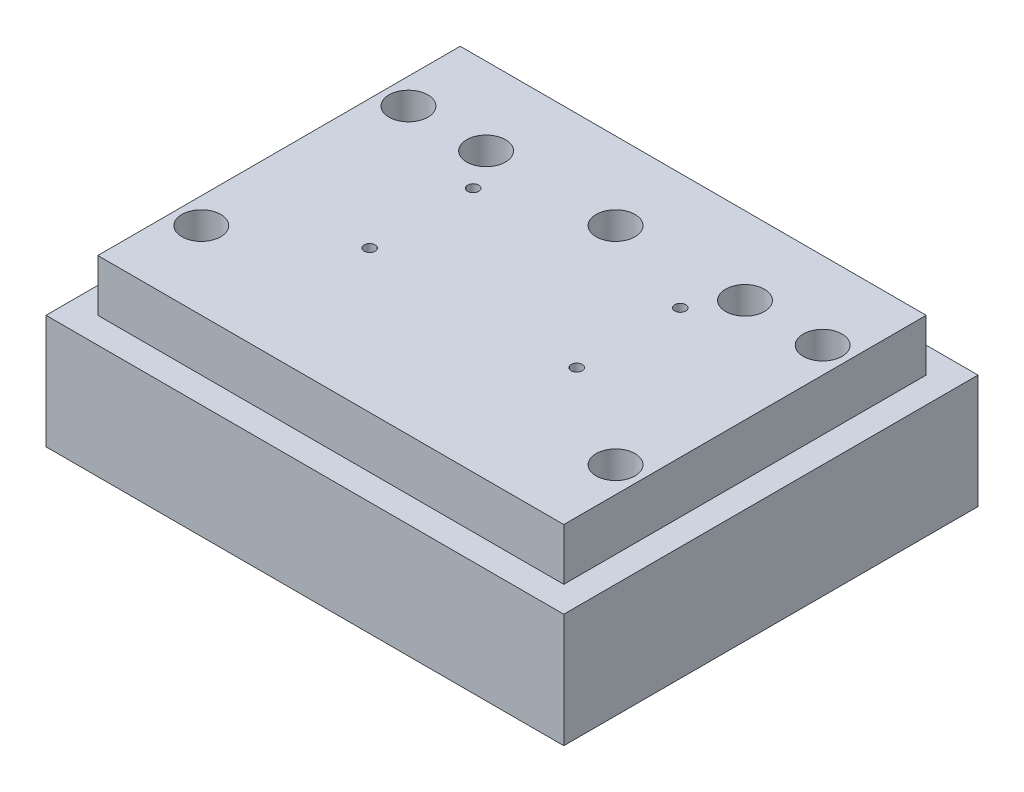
from build123d import *

# Parameters (mm, degrees)
SKETCH1_W                        = 127
SKETCH1_H                        = 101.6
BOSS_EXTRUDE1_DEPTH              = 27.94
SKETCH2_W                        = 114.3
SKETCH2_H                        = 88.9
BOSS_EXTRUDE2_DEPTH              = 12.7
F_3_8_0_375_DIAMETER_HOLE1_D     = 9.525
F_3_8_0_375_DIAMETER_HOLE2_D     = 9.525
F_3_8_0_375_DIAMETER_HOLE2_DEPTH = 33.02
F_3_8_0_375_DIAMETER_HOLE2_TIP   = 2.861599
F_3_8_24_TAPPED_HOLE1_D          = 8.4328
F_3_8_24_TAPPED_HOLE1_DEPTH      = 25.4
F_3_8_24_TAPPED_HOLE1_TIP        = 2.533469
F_3_8_0_375_DIAMETER_HOLE3_D     = 9.525
F_3_8_0_375_DIAMETER_HOLE3_DEPTH = 25.4
F_3_8_0_375_DIAMETER_HOLE3_TIP   = 2.861599
F_6_32_TAPPED_HOLE1_D            = 2.7051
F_6_32_TAPPED_HOLE1_DEPTH        = 7.62
F_6_32_TAPPED_HOLE1_TIP          = 0.812694
SKETCH15_W                       = 29.21
SKETCH15_H                       = 11.43
SKETCH15_W_2                     = 20.828
CUT_EXTRUDE1_DEPTH               = 12.7
F_4_40_TAPPED_HOLE1_D            = 2.2606
F_4_40_TAPPED_HOLE1_DEPTH        = 9.525
F_4_40_TAPPED_HOLE1_TIP          = 0.679153


with BuildPart() as part:
    # Sketch1 → Boss-Extrude1 (new body)
    with BuildSketch(Plane(origin=(0, 0, 0), x_dir=(1, 0, 0), z_dir=(0, 1, 0))):
        with Locations((16.703575, -30.001589)):
            Rectangle(SKETCH1_W, SKETCH1_H)
    extrude(amount=BOSS_EXTRUDE1_DEPTH)

    # Sketch2 → Boss-Extrude2 (add)
    with BuildSketch(Plane(origin=(0, 27.94, 0), x_dir=(1, 0, 0), z_dir=(0, 1, 0))):
        with Locations((16.703575, -30.001589)):
            Rectangle(SKETCH2_W, SKETCH2_H)
    extrude(amount=BOSS_EXTRUDE2_DEPTH)

    # 3_8 _0.375_ Diameter Hole1 (through all)
    with Locations(Plane(origin=(0, 40.64, 0), x_dir=(1, 0, 0), z_dir=(0, 1, 0))):
        with Locations((-34.096425, -4.601589), (67.503575, -4.601589), (-34.096425, -55.401589), (67.503575, -55.401589)):
            Hole(F_3_8_0_375_DIAMETER_HOLE1_D / 2)

    # 3_8 _0.375_ Diameter Hole2
    with Locations(Plane(origin=(0, 40.64, 0), x_dir=(1, 0, 0), z_dir=(0, 1, 0))):
        with Locations((-15.046425, -4.601589), (16.703575, -4.601589), (48.453575, -4.601589)):
            Hole(F_3_8_0_375_DIAMETER_HOLE2_D / 2, depth=F_3_8_0_375_DIAMETER_HOLE2_DEPTH)
            with Locations((0, 0, -(F_3_8_0_375_DIAMETER_HOLE2_DEPTH + F_3_8_0_375_DIAMETER_HOLE2_TIP / 2))):  # 118° drill point
                Cone(0, F_3_8_0_375_DIAMETER_HOLE2_D / 2, F_3_8_0_375_DIAMETER_HOLE2_TIP, mode=Mode.SUBTRACT)

    # 3_8-24 Tapped Hole1
    with Locations(Plane(origin=(0, 0, -20.798411), x_dir=(-1, 0, 0), z_dir=(0, 0, -1))):
        with Locations((-16.703575, 12.7)):
            Hole(F_3_8_24_TAPPED_HOLE1_D / 2, depth=F_3_8_24_TAPPED_HOLE1_DEPTH)
            with Locations((0, 0, -(F_3_8_24_TAPPED_HOLE1_DEPTH + F_3_8_24_TAPPED_HOLE1_TIP / 2))):  # 118° drill point
                Cone(0, F_3_8_24_TAPPED_HOLE1_D / 2, F_3_8_24_TAPPED_HOLE1_TIP, mode=Mode.SUBTRACT)

    # 3_8 _0.375_ Diameter Hole3
    with Locations(Plane(origin=(0, 0, -20.798411), x_dir=(-1, 0, 0), z_dir=(0, 0, -1))):
        with Locations((-48.453575, 12.7), (15.046425, 12.7)):
            Hole(F_3_8_0_375_DIAMETER_HOLE3_D / 2, depth=F_3_8_0_375_DIAMETER_HOLE3_DEPTH)
            with Locations((0, 0, -(F_3_8_0_375_DIAMETER_HOLE3_DEPTH + F_3_8_0_375_DIAMETER_HOLE3_TIP / 2))):  # 118° drill point
                Cone(0, F_3_8_0_375_DIAMETER_HOLE3_D / 2, F_3_8_0_375_DIAMETER_HOLE3_TIP, mode=Mode.SUBTRACT)

    # 6-32 Tapped Hole1
    with Locations(Plane(origin=(0, 40.64, 0), x_dir=(1, 0, 0), z_dir=(0, 1, 0))):
        with Locations((-8.696425, -14.126589), (42.103575, -14.126589), (42.103575, -39.526589), (-8.696425, -39.526589)):
            Hole(F_6_32_TAPPED_HOLE1_D / 2, depth=F_6_32_TAPPED_HOLE1_DEPTH)
            with Locations((0, 0, -(F_6_32_TAPPED_HOLE1_DEPTH + F_6_32_TAPPED_HOLE1_TIP / 2))):  # 118° drill point
                Cone(0, F_6_32_TAPPED_HOLE1_D / 2, F_6_32_TAPPED_HOLE1_TIP, mode=Mode.SUBTRACT)

    # Sketch15 → Cut-Extrude1 (cut)
    with BuildSketch(Plane(origin=(0, 0, -20.798411), x_dir=(-1, 0, 0), z_dir=(0, 0, -1))):
        with Locations((-48.453575, 12.7)):
            Rectangle(SKETCH15_W, SKETCH15_H)
        with Locations((15.046425, 12.7)):
            Rectangle(SKETCH15_W_2, SKETCH15_H)
    extrude(amount=-CUT_EXTRUDE1_DEPTH, mode=Mode.SUBTRACT)

    # 4-40 Tapped Hole1
    with Locations(Plane(origin=(0, 0, -20.798411), x_dir=(-1, 0, 0), z_dir=(0, 0, -1))):
        with Locations((-65.115975, 12.7), (-31.791175, 12.7), (2.549625, 12.7), (27.543225, 12.7)):
            Hole(F_4_40_TAPPED_HOLE1_D / 2, depth=F_4_40_TAPPED_HOLE1_DEPTH)
            with Locations((0, 0, -(F_4_40_TAPPED_HOLE1_DEPTH + F_4_40_TAPPED_HOLE1_TIP / 2))):  # 118° drill point
                Cone(0, F_4_40_TAPPED_HOLE1_D / 2, F_4_40_TAPPED_HOLE1_TIP, mode=Mode.SUBTRACT)


solid = part.part
